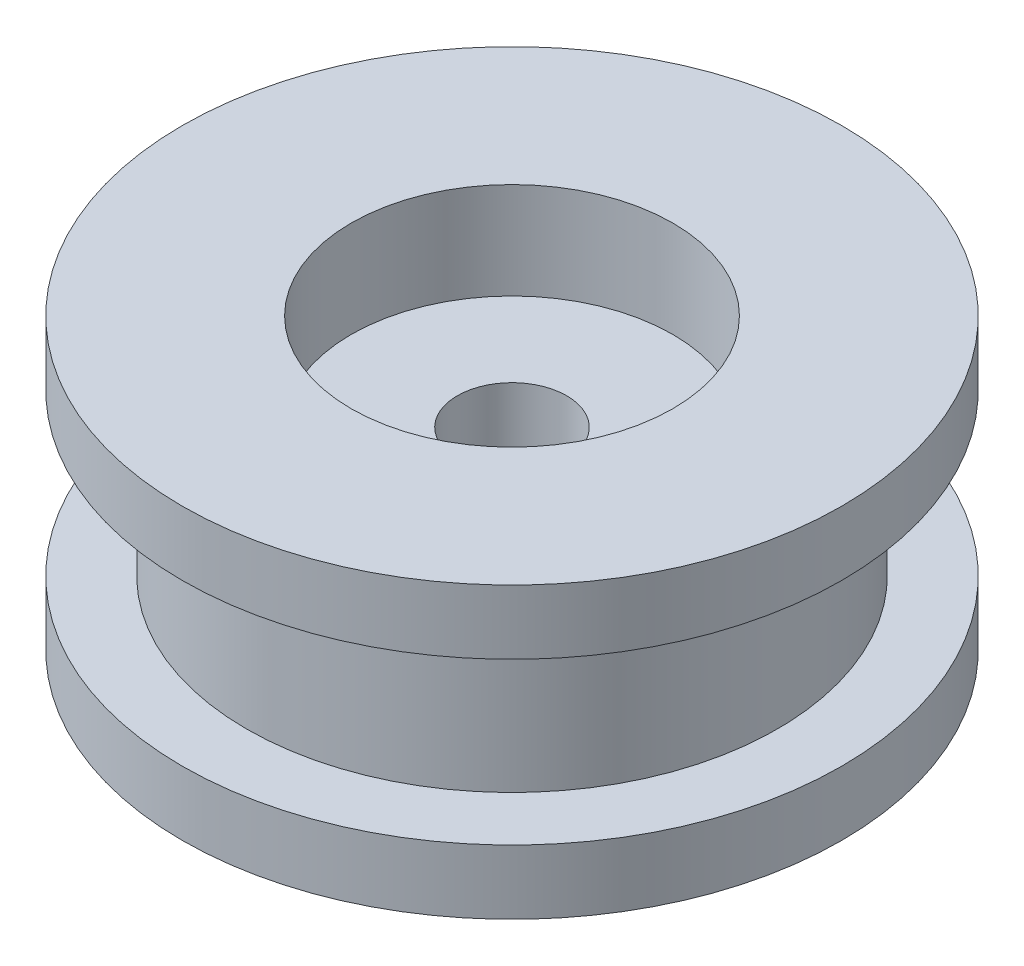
ISO-10303-21;
HEADER;
FILE_DESCRIPTION(('STEP AP214'),'2;1');
FILE_NAME('part.step','',(''),(''),'','','');
FILE_SCHEMA(('AUTOMOTIVE_DESIGN { 1 0 10303 214 1 1 1 1 }'));
ENDSEC;
DATA;
#1=APPLICATION_CONTEXT('core data for automotive mechanical design processes');
#2=APPLICATION_PROTOCOL_DEFINITION('international standard','automotive_design',2000,#1);
#3=PRODUCT_CONTEXT('',#1,'mechanical');
#4=PRODUCT('Part','Part','',(#3));
#5=PRODUCT_RELATED_PRODUCT_CATEGORY('part','',(#4));
#6=PRODUCT_DEFINITION_FORMATION('','',#4);
#7=PRODUCT_DEFINITION_CONTEXT('part definition',#1,'design');
#8=PRODUCT_DEFINITION('design','',#6,#7);
#9=PRODUCT_DEFINITION_SHAPE('','',#8);
#10=(LENGTH_UNIT() NAMED_UNIT(*) SI_UNIT(.MILLI.,.METRE.));
#11=(NAMED_UNIT(*) PLANE_ANGLE_UNIT() SI_UNIT($,.RADIAN.));
#12=(NAMED_UNIT(*) SI_UNIT($,.STERADIAN.) SOLID_ANGLE_UNIT());
#13=UNCERTAINTY_MEASURE_WITH_UNIT(LENGTH_MEASURE(1.E-05),#10,'distance_accuracy_value','');
#14=(GEOMETRIC_REPRESENTATION_CONTEXT(3) GLOBAL_UNCERTAINTY_ASSIGNED_CONTEXT((#13)) GLOBAL_UNIT_ASSIGNED_CONTEXT((#10,
#11,#12)) REPRESENTATION_CONTEXT('',''));
#15=CARTESIAN_POINT('',(0.,0.,0.));
#16=DIRECTION('',(0.,0.,1.));
#17=DIRECTION('',(1.,0.,0.));
#18=AXIS2_PLACEMENT_3D('',#15,#16,#17);
#19=CARTESIAN_POINT('',(-51.,54.,0.));
#20=DIRECTION('',(0.,-1.,0.));
#21=DIRECTION('',(0.,0.,-1.));
#22=AXIS2_PLACEMENT_3D('',#19,#20,#21);
#23=PLANE('',#22);
#24=CARTESIAN_POINT('',(-41.,54.,0.));
#25=DIRECTION('',(0.,-1.,0.));
#26=DIRECTION('',(0.,0.,-1.));
#27=AXIS2_PLACEMENT_3D('',#24,#25,#26);
#28=CIRCLE('',#27,20.5);
#29=CARTESIAN_POINT('',(-41.,54.,-20.5));
#30=VERTEX_POINT('',#29);
#31=EDGE_CURVE('E10',#30,#30,#28,.T.);
#32=ORIENTED_EDGE('',*,*,#31,.F.);
#33=EDGE_LOOP('',(#32));
#34=FACE_BOUND('',#33,.T.);
#35=CARTESIAN_POINT('',(-41.,54.,0.));
#36=DIRECTION('',(0.,-1.,0.));
#37=DIRECTION('',(0.,0.,-1.));
#38=AXIS2_PLACEMENT_3D('',#35,#36,#37);
#39=CIRCLE('',#38,10.);
#40=CARTESIAN_POINT('',(-41.,54.,-10.));
#41=VERTEX_POINT('',#40);
#42=EDGE_CURVE('E63',#41,#41,#39,.T.);
#43=ORIENTED_EDGE('',*,*,#42,.T.);
#44=EDGE_LOOP('',(#43));
#45=FACE_BOUND('',#44,.T.);
#46=ADVANCED_FACE('F29',(#34,#45),#23,.F.);
#47=CARTESIAN_POINT('',(-41.,42.,0.));
#48=DIRECTION('',(0.,-1.,0.));
#49=DIRECTION('',(0.,0.,-1.));
#50=AXIS2_PLACEMENT_3D('',#47,#48,#49);
#51=CYLINDRICAL_SURFACE('',#50,20.5);
#52=CARTESIAN_POINT('',(-41.,50.,0.));
#53=DIRECTION('',(0.,-1.,0.));
#54=DIRECTION('',(0.,0.,-1.));
#55=AXIS2_PLACEMENT_3D('',#52,#53,#54);
#56=CIRCLE('',#55,20.5);
#57=CARTESIAN_POINT('',(-41.,50.,-20.5));
#58=VERTEX_POINT('',#57);
#59=EDGE_CURVE('E36',#58,#58,#56,.T.);
#60=ORIENTED_EDGE('',*,*,#59,.F.);
#61=EDGE_LOOP('',(#60));
#62=FACE_BOUND('',#61,.T.);
#63=ORIENTED_EDGE('',*,*,#31,.T.);
#64=EDGE_LOOP('',(#63));
#65=FACE_BOUND('',#64,.T.);
#66=ADVANCED_FACE('F86',(#62,#65),#51,.T.);
#67=CARTESIAN_POINT('',(-61.5,50.,0.));
#68=DIRECTION('',(0.,1.,0.));
#69=DIRECTION('',(0.,0.,1.));
#70=AXIS2_PLACEMENT_3D('',#67,#68,#69);
#71=PLANE('',#70);
#72=CARTESIAN_POINT('',(-41.,50.,0.));
#73=DIRECTION('',(0.,-1.,0.));
#74=DIRECTION('',(0.,0.,-1.));
#75=AXIS2_PLACEMENT_3D('',#72,#73,#74);
#76=CIRCLE('',#75,16.5);
#77=CARTESIAN_POINT('',(-41.,50.,-16.5));
#78=VERTEX_POINT('',#77);
#79=EDGE_CURVE('E40',#78,#78,#76,.T.);
#80=ORIENTED_EDGE('',*,*,#79,.F.);
#81=EDGE_LOOP('',(#80));
#82=FACE_BOUND('',#81,.T.);
#83=ORIENTED_EDGE('',*,*,#59,.T.);
#84=EDGE_LOOP('',(#83));
#85=FACE_BOUND('',#84,.T.);
#86=ADVANCED_FACE('F91',(#82,#85),#71,.F.);
#87=CARTESIAN_POINT('',(-41.,42.,0.));
#88=DIRECTION('',(0.,-1.,0.));
#89=DIRECTION('',(0.,0.,-1.));
#90=AXIS2_PLACEMENT_3D('',#87,#88,#89);
#91=CYLINDRICAL_SURFACE('',#90,16.5);
#92=CARTESIAN_POINT('',(-41.,40.,0.));
#93=DIRECTION('',(0.,-1.,0.));
#94=DIRECTION('',(0.,0.,-1.));
#95=AXIS2_PLACEMENT_3D('',#92,#93,#94);
#96=CIRCLE('',#95,16.5);
#97=CARTESIAN_POINT('',(-41.,40.,-16.5));
#98=VERTEX_POINT('',#97);
#99=EDGE_CURVE('E45',#98,#98,#96,.T.);
#100=ORIENTED_EDGE('',*,*,#99,.F.);
#101=EDGE_LOOP('',(#100));
#102=FACE_BOUND('',#101,.T.);
#103=ORIENTED_EDGE('',*,*,#79,.T.);
#104=EDGE_LOOP('',(#103));
#105=FACE_BOUND('',#104,.T.);
#106=ADVANCED_FACE('F121',(#102,#105),#91,.T.);
#107=CARTESIAN_POINT('',(-61.5,40.,0.));
#108=DIRECTION('',(0.,-1.,0.));
#109=DIRECTION('',(0.,0.,-1.));
#110=AXIS2_PLACEMENT_3D('',#107,#108,#109);
#111=PLANE('',#110);
#112=CARTESIAN_POINT('',(-41.,40.,0.));
#113=DIRECTION('',(0.,-1.,0.));
#114=DIRECTION('',(0.,0.,-1.));
#115=AXIS2_PLACEMENT_3D('',#112,#113,#114);
#116=CIRCLE('',#115,20.5);
#117=CARTESIAN_POINT('',(-41.,40.,-20.5));
#118=VERTEX_POINT('',#117);
#119=EDGE_CURVE('E48',#118,#118,#116,.T.);
#120=ORIENTED_EDGE('',*,*,#119,.F.);
#121=EDGE_LOOP('',(#120));
#122=FACE_BOUND('',#121,.T.);
#123=ORIENTED_EDGE('',*,*,#99,.T.);
#124=EDGE_LOOP('',(#123));
#125=FACE_BOUND('',#124,.T.);
#126=ADVANCED_FACE('F117',(#122,#125),#111,.F.);
#127=CARTESIAN_POINT('',(-41.,42.,0.));
#128=DIRECTION('',(0.,-1.,0.));
#129=DIRECTION('',(0.,0.,-1.));
#130=AXIS2_PLACEMENT_3D('',#127,#128,#129);
#131=CYLINDRICAL_SURFACE('',#130,20.5);
#132=CARTESIAN_POINT('',(-41.,36.,0.));
#133=DIRECTION('',(0.,-1.,0.));
#134=DIRECTION('',(0.,0.,-1.));
#135=AXIS2_PLACEMENT_3D('',#132,#133,#134);
#136=CIRCLE('',#135,20.5);
#137=CARTESIAN_POINT('',(-41.,36.,-20.5));
#138=VERTEX_POINT('',#137);
#139=EDGE_CURVE('E51',#138,#138,#136,.T.);
#140=ORIENTED_EDGE('',*,*,#139,.F.);
#141=EDGE_LOOP('',(#140));
#142=FACE_BOUND('',#141,.T.);
#143=ORIENTED_EDGE('',*,*,#119,.T.);
#144=EDGE_LOOP('',(#143));
#145=FACE_BOUND('',#144,.T.);
#146=ADVANCED_FACE('F113',(#142,#145),#131,.T.);
#147=CARTESIAN_POINT('',(-51.,36.,0.));
#148=DIRECTION('',(0.,1.,0.));
#149=DIRECTION('',(0.,0.,1.));
#150=AXIS2_PLACEMENT_3D('',#147,#148,#149);
#151=PLANE('',#150);
#152=CARTESIAN_POINT('',(-41.,36.,0.));
#153=DIRECTION('',(0.,-1.,0.));
#154=DIRECTION('',(0.,0.,-1.));
#155=AXIS2_PLACEMENT_3D('',#152,#153,#154);
#156=CIRCLE('',#155,10.);
#157=CARTESIAN_POINT('',(-41.,36.,-10.));
#158=VERTEX_POINT('',#157);
#159=EDGE_CURVE('E54',#158,#158,#156,.T.);
#160=ORIENTED_EDGE('',*,*,#159,.F.);
#161=EDGE_LOOP('',(#160));
#162=FACE_BOUND('',#161,.T.);
#163=ORIENTED_EDGE('',*,*,#139,.T.);
#164=EDGE_LOOP('',(#163));
#165=FACE_BOUND('',#164,.T.);
#166=ADVANCED_FACE('F109',(#162,#165),#151,.F.);
#167=CARTESIAN_POINT('',(-41.,42.,0.));
#168=DIRECTION('',(0.,-1.,0.));
#169=DIRECTION('',(0.,0.,-1.));
#170=AXIS2_PLACEMENT_3D('',#167,#168,#169);
#171=CYLINDRICAL_SURFACE('',#170,10.);
#172=CARTESIAN_POINT('',(-41.,42.,0.));
#173=DIRECTION('',(0.,-1.,0.));
#174=DIRECTION('',(0.,0.,-1.));
#175=AXIS2_PLACEMENT_3D('',#172,#173,#174);
#176=CIRCLE('',#175,10.);
#177=CARTESIAN_POINT('',(-41.,42.,-10.));
#178=VERTEX_POINT('',#177);
#179=EDGE_CURVE('E57',#178,#178,#176,.T.);
#180=ORIENTED_EDGE('',*,*,#179,.F.);
#181=EDGE_LOOP('',(#180));
#182=FACE_BOUND('',#181,.T.);
#183=ORIENTED_EDGE('',*,*,#159,.T.);
#184=EDGE_LOOP('',(#183));
#185=FACE_BOUND('',#184,.T.);
#186=ADVANCED_FACE('F103',(#182,#185),#171,.F.);
#187=CARTESIAN_POINT('',(-41.,42.,0.));
#188=DIRECTION('',(0.,1.,0.));
#189=DIRECTION('',(0.,0.,1.));
#190=AXIS2_PLACEMENT_3D('',#187,#188,#189);
#191=PLANE('',#190);
#192=CARTESIAN_POINT('',(-41.,42.,0.));
#193=DIRECTION('',(0.,-1.,0.));
#194=DIRECTION('',(0.,0.,-1.));
#195=AXIS2_PLACEMENT_3D('',#192,#193,#194);
#196=CIRCLE('',#195,3.4);
#197=CARTESIAN_POINT('',(-41.,42.,-3.4));
#198=VERTEX_POINT('',#197);
#199=EDGE_CURVE('E66',#198,#198,#196,.T.);
#200=ORIENTED_EDGE('',*,*,#199,.F.);
#201=EDGE_LOOP('',(#200));
#202=FACE_BOUND('',#201,.T.);
#203=ORIENTED_EDGE('',*,*,#179,.T.);
#204=EDGE_LOOP('',(#203));
#205=FACE_BOUND('',#204,.T.);
#206=ADVANCED_FACE('F98',(#202,#205),#191,.F.);
#207=CARTESIAN_POINT('',(-41.,48.,0.));
#208=DIRECTION('',(0.,-1.,0.));
#209=DIRECTION('',(0.,0.,-1.));
#210=AXIS2_PLACEMENT_3D('',#207,#208,#209);
#211=PLANE('',#210);
#212=CARTESIAN_POINT('',(-41.,48.,0.));
#213=DIRECTION('',(0.,-1.,0.));
#214=DIRECTION('',(0.,0.,-1.));
#215=AXIS2_PLACEMENT_3D('',#212,#213,#214);
#216=CIRCLE('',#215,3.4);
#217=CARTESIAN_POINT('',(-41.,48.,-3.4));
#218=VERTEX_POINT('',#217);
#219=EDGE_CURVE('E32',#218,#218,#216,.T.);
#220=ORIENTED_EDGE('',*,*,#219,.T.);
#221=EDGE_LOOP('',(#220));
#222=FACE_BOUND('',#221,.T.);
#223=CARTESIAN_POINT('',(-41.,48.,0.));
#224=DIRECTION('',(0.,-1.,0.));
#225=DIRECTION('',(0.,0.,-1.));
#226=AXIS2_PLACEMENT_3D('',#223,#224,#225);
#227=CIRCLE('',#226,9.99999999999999);
#228=CARTESIAN_POINT('',(-41.,48.,-9.99999999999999));
#229=VERTEX_POINT('',#228);
#230=EDGE_CURVE('E60',#229,#229,#227,.T.);
#231=ORIENTED_EDGE('',*,*,#230,.F.);
#232=EDGE_LOOP('',(#231));
#233=FACE_BOUND('',#232,.T.);
#234=ADVANCED_FACE('F73',(#222,#233),#211,.F.);
#235=CARTESIAN_POINT('',(-41.,42.,0.));
#236=DIRECTION('',(0.,-1.,0.));
#237=DIRECTION('',(0.,0.,-1.));
#238=AXIS2_PLACEMENT_3D('',#235,#236,#237);
#239=CYLINDRICAL_SURFACE('',#238,10.);
#240=ORIENTED_EDGE('',*,*,#42,.F.);
#241=EDGE_LOOP('',(#240));
#242=FACE_BOUND('',#241,.T.);
#243=ORIENTED_EDGE('',*,*,#230,.T.);
#244=EDGE_LOOP('',(#243));
#245=FACE_BOUND('',#244,.T.);
#246=ADVANCED_FACE('F78',(#242,#245),#239,.F.);
#247=CARTESIAN_POINT('',(-41.,42.,0.));
#248=DIRECTION('',(0.,-1.,0.));
#249=DIRECTION('',(0.,0.,-1.));
#250=AXIS2_PLACEMENT_3D('',#247,#248,#249);
#251=CYLINDRICAL_SURFACE('',#250,3.4);
#252=ORIENTED_EDGE('',*,*,#199,.T.);
#253=EDGE_LOOP('',(#252));
#254=FACE_BOUND('',#253,.T.);
#255=ORIENTED_EDGE('',*,*,#219,.F.);
#256=EDGE_LOOP('',(#255));
#257=FACE_BOUND('',#256,.T.);
#258=ADVANCED_FACE('F76',(#254,#257),#251,.F.);
#259=CLOSED_SHELL('',(#46,#66,#86,#106,#126,#146,#166,#186,#206,#234,#246,#258));
#260=MANIFOLD_SOLID_BREP('B2',#259);
#261=ADVANCED_BREP_SHAPE_REPRESENTATION('',(#18,#260),#14);
#262=SHAPE_DEFINITION_REPRESENTATION(#9,#261);
ENDSEC;
END-ISO-10303-21;
